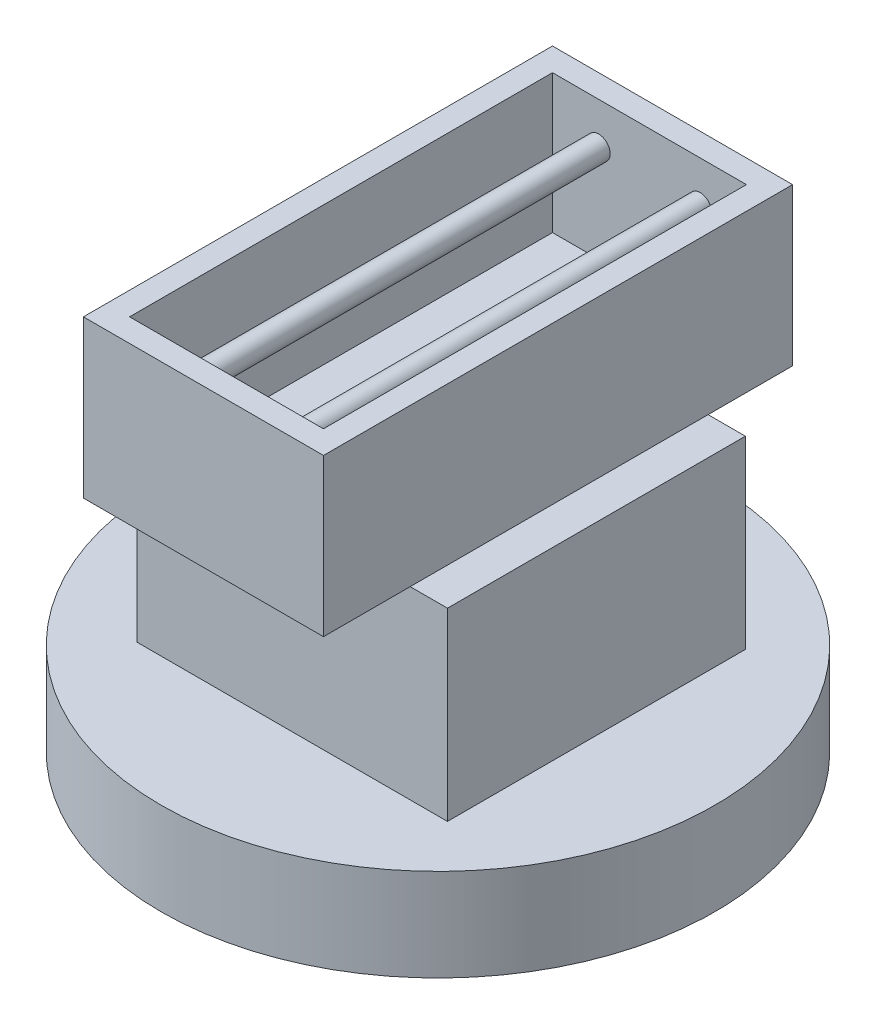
ISO-10303-21;
HEADER;
FILE_DESCRIPTION(('STEP AP214'),'2;1');
FILE_NAME('part.step','',(''),(''),'','','');
FILE_SCHEMA(('AUTOMOTIVE_DESIGN { 1 0 10303 214 1 1 1 1 }'));
ENDSEC;
DATA;
#1=APPLICATION_CONTEXT('core data for automotive mechanical design processes');
#2=APPLICATION_PROTOCOL_DEFINITION('international standard','automotive_design',2000,#1);
#3=PRODUCT_CONTEXT('',#1,'mechanical');
#4=PRODUCT('Part','Part','',(#3));
#5=PRODUCT_RELATED_PRODUCT_CATEGORY('part','',(#4));
#6=PRODUCT_DEFINITION_FORMATION('','',#4);
#7=PRODUCT_DEFINITION_CONTEXT('part definition',#1,'design');
#8=PRODUCT_DEFINITION('design','',#6,#7);
#9=PRODUCT_DEFINITION_SHAPE('','',#8);
#10=(LENGTH_UNIT() NAMED_UNIT(*) SI_UNIT(.MILLI.,.METRE.));
#11=(NAMED_UNIT(*) PLANE_ANGLE_UNIT() SI_UNIT($,.RADIAN.));
#12=(NAMED_UNIT(*) SI_UNIT($,.STERADIAN.) SOLID_ANGLE_UNIT());
#13=UNCERTAINTY_MEASURE_WITH_UNIT(LENGTH_MEASURE(1.E-05),#10,'distance_accuracy_value','');
#14=(GEOMETRIC_REPRESENTATION_CONTEXT(3) GLOBAL_UNCERTAINTY_ASSIGNED_CONTEXT((#13)) GLOBAL_UNIT_ASSIGNED_CONTEXT((#10,
#11,#12)) REPRESENTATION_CONTEXT('',''));
#15=CARTESIAN_POINT('',(0.,0.,0.));
#16=DIRECTION('',(0.,0.,1.));
#17=DIRECTION('',(1.,0.,0.));
#18=AXIS2_PLACEMENT_3D('',#15,#16,#17);
#19=CARTESIAN_POINT('',(34.0744268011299,60.,32.0256268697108));
#20=DIRECTION('',(0.,-1.,0.));
#21=DIRECTION('',(0.,0.,-1.));
#22=AXIS2_PLACEMENT_3D('',#19,#20,#21);
#23=PLANE('',#22);
#24=DIRECTION('',(0.,0.,-1.));
#25=VECTOR('',#24,1.);
#26=CARTESIAN_POINT('',(26.,60.,-50.8));
#27=LINE('',#26,#25);
#28=CARTESIAN_POINT('',(26.,60.,32.0256268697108));
#29=VERTEX_POINT('',#28);
#30=CARTESIAN_POINT('',(26.,60.,-32.5028693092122));
#31=VERTEX_POINT('',#30);
#32=EDGE_CURVE('E11',#29,#31,#27,.T.);
#33=ORIENTED_EDGE('',*,*,#32,.F.);
#34=DIRECTION('',(1.,0.,0.));
#35=VECTOR('',#34,1.);
#36=CARTESIAN_POINT('',(34.0744268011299,60.,32.0256268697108));
#37=LINE('',#36,#35);
#38=CARTESIAN_POINT('',(34.0744268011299,60.,32.0256268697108));
#39=VERTEX_POINT('',#38);
#40=EDGE_CURVE('E219',#29,#39,#37,.T.);
#41=ORIENTED_EDGE('',*,*,#40,.T.);
#42=DIRECTION('',(0.,0.,-1.));
#43=VECTOR('',#42,1.);
#44=CARTESIAN_POINT('',(34.0744268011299,60.,-32.5028693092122));
#45=LINE('',#44,#43);
#46=CARTESIAN_POINT('',(34.0744268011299,60.,-32.5028693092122));
#47=VERTEX_POINT('',#46);
#48=EDGE_CURVE('E210',#39,#47,#45,.T.);
#49=ORIENTED_EDGE('',*,*,#48,.T.);
#50=DIRECTION('',(-1.,0.,0.));
#51=VECTOR('',#50,1.);
#52=CARTESIAN_POINT('',(34.0744268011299,60.,-32.5028693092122));
#53=LINE('',#52,#51);
#54=EDGE_CURVE('E214',#47,#31,#53,.T.);
#55=ORIENTED_EDGE('',*,*,#54,.T.);
#56=EDGE_LOOP('',(#33,#41,#49,#55));
#57=FACE_BOUND('',#56,.T.);
#58=ADVANCED_FACE('F26',(#57),#23,.F.);
#59=DIRECTION('',(0.,0.,1.));
#60=VECTOR('',#59,1.);
#61=CARTESIAN_POINT('',(-26.,60.,-50.8));
#62=LINE('',#61,#60);
#63=CARTESIAN_POINT('',(-26.,60.,-32.5028693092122));
#64=VERTEX_POINT('',#63);
#65=CARTESIAN_POINT('',(-26.,60.,32.0256268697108));
#66=VERTEX_POINT('',#65);
#67=EDGE_CURVE('E35',#64,#66,#62,.T.);
#68=ORIENTED_EDGE('',*,*,#67,.F.);
#69=CARTESIAN_POINT('',(-33.1710996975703,60.,-32.5028693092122));
#70=VERTEX_POINT('',#69);
#71=EDGE_CURVE('E213',#64,#70,#53,.T.);
#72=ORIENTED_EDGE('',*,*,#71,.T.);
#73=DIRECTION('',(0.,0.,1.));
#74=VECTOR('',#73,1.);
#75=CARTESIAN_POINT('',(-33.1710996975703,60.,-32.5028693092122));
#76=LINE('',#75,#74);
#77=CARTESIAN_POINT('',(-33.1710996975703,60.,32.0256268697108));
#78=VERTEX_POINT('',#77);
#79=EDGE_CURVE('E216',#70,#78,#76,.T.);
#80=ORIENTED_EDGE('',*,*,#79,.T.);
#81=EDGE_CURVE('E220',#78,#66,#37,.T.);
#82=ORIENTED_EDGE('',*,*,#81,.T.);
#83=EDGE_LOOP('',(#68,#72,#80,#82));
#84=FACE_BOUND('',#83,.T.);
#85=ADVANCED_FACE('F272',(#84),#23,.F.);
#86=CARTESIAN_POINT('',(0.,20.,0.));
#87=DIRECTION('',(0.,1.,0.));
#88=DIRECTION('',(0.,0.,1.));
#89=AXIS2_PLACEMENT_3D('',#86,#87,#88);
#90=PLANE('',#89);
#91=CARTESIAN_POINT('',(0.,20.,0.));
#92=DIRECTION('',(0.,1.,0.));
#93=DIRECTION('',(0.,0.,1.));
#94=AXIS2_PLACEMENT_3D('',#91,#92,#93);
#95=CIRCLE('',#94,60.);
#96=CARTESIAN_POINT('',(0.,20.,60.));
#97=VERTEX_POINT('',#96);
#98=EDGE_CURVE('E236',#97,#97,#95,.T.);
#99=ORIENTED_EDGE('',*,*,#98,.T.);
#100=EDGE_LOOP('',(#99));
#101=FACE_BOUND('',#100,.T.);
#102=DIRECTION('',(-1.,0.,0.));
#103=VECTOR('',#102,1.);
#104=CARTESIAN_POINT('',(34.0744268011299,20.,-32.5028693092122));
#105=LINE('',#104,#103);
#106=CARTESIAN_POINT('',(34.0744268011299,20.,-32.5028693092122));
#107=VERTEX_POINT('',#106);
#108=CARTESIAN_POINT('',(-33.1710996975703,20.,-32.5028693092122));
#109=VERTEX_POINT('',#108);
#110=EDGE_CURVE('E203',#107,#109,#105,.T.);
#111=ORIENTED_EDGE('',*,*,#110,.F.);
#112=DIRECTION('',(0.,0.,-1.));
#113=VECTOR('',#112,1.);
#114=CARTESIAN_POINT('',(34.0744268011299,20.,-32.5028693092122));
#115=LINE('',#114,#113);
#116=CARTESIAN_POINT('',(34.0744268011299,20.,32.0256268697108));
#117=VERTEX_POINT('',#116);
#118=EDGE_CURVE('E200',#117,#107,#115,.T.);
#119=ORIENTED_EDGE('',*,*,#118,.F.);
#120=DIRECTION('',(1.,0.,0.));
#121=VECTOR('',#120,1.);
#122=CARTESIAN_POINT('',(34.0744268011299,20.,32.0256268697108));
#123=LINE('',#122,#121);
#124=CARTESIAN_POINT('',(-33.1710996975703,20.,32.0256268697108));
#125=VERTEX_POINT('',#124);
#126=EDGE_CURVE('E208',#125,#117,#123,.T.);
#127=ORIENTED_EDGE('',*,*,#126,.F.);
#128=DIRECTION('',(0.,0.,1.));
#129=VECTOR('',#128,1.);
#130=CARTESIAN_POINT('',(-33.1710996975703,20.,-32.5028693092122));
#131=LINE('',#130,#129);
#132=EDGE_CURVE('E205',#109,#125,#131,.T.);
#133=ORIENTED_EDGE('',*,*,#132,.F.);
#134=EDGE_LOOP('',(#111,#119,#127,#133));
#135=FACE_BOUND('',#134,.T.);
#136=ADVANCED_FACE('F278',(#101,#135),#90,.T.);
#137=CARTESIAN_POINT('',(0.,-20.,0.));
#138=DIRECTION('',(0.,1.,0.));
#139=DIRECTION('',(0.,0.,1.));
#140=AXIS2_PLACEMENT_3D('',#137,#138,#139);
#141=CYLINDRICAL_SURFACE('',#140,25.);
#142=CARTESIAN_POINT('',(0.,-20.,0.));
#143=DIRECTION('',(0.,1.,0.));
#144=DIRECTION('',(0.,0.,1.));
#145=AXIS2_PLACEMENT_3D('',#142,#143,#144);
#146=CIRCLE('',#145,25.);
#147=CARTESIAN_POINT('',(0.,-20.,25.));
#148=VERTEX_POINT('',#147);
#149=EDGE_CURVE('E242',#148,#148,#146,.T.);
#150=ORIENTED_EDGE('',*,*,#149,.T.);
#151=EDGE_LOOP('',(#150));
#152=FACE_BOUND('',#151,.T.);
#153=CARTESIAN_POINT('',(0.,0.,0.));
#154=DIRECTION('',(0.,1.,0.));
#155=DIRECTION('',(0.,0.,1.));
#156=AXIS2_PLACEMENT_3D('',#153,#154,#155);
#157=CIRCLE('',#156,25.);
#158=CARTESIAN_POINT('',(0.,0.,25.));
#159=VERTEX_POINT('',#158);
#160=EDGE_CURVE('E239',#159,#159,#157,.T.);
#161=ORIENTED_EDGE('',*,*,#160,.F.);
#162=EDGE_LOOP('',(#161));
#163=FACE_BOUND('',#162,.T.);
#164=ADVANCED_FACE('F28',(#152,#163),#141,.T.);
#165=CARTESIAN_POINT('',(0.,-20.,0.));
#166=DIRECTION('',(0.,1.,0.));
#167=DIRECTION('',(0.,0.,1.));
#168=AXIS2_PLACEMENT_3D('',#165,#166,#167);
#169=PLANE('',#168);
#170=ORIENTED_EDGE('',*,*,#149,.F.);
#171=EDGE_LOOP('',(#170));
#172=FACE_BOUND('',#171,.T.);
#173=ADVANCED_FACE('F309',(#172),#169,.F.);
#174=CARTESIAN_POINT('',(0.,20.,0.));
#175=DIRECTION('',(0.,-1.,0.));
#176=DIRECTION('',(0.,0.,-1.));
#177=AXIS2_PLACEMENT_3D('',#174,#175,#176);
#178=CYLINDRICAL_SURFACE('',#177,60.);
#179=ORIENTED_EDGE('',*,*,#98,.F.);
#180=EDGE_LOOP('',(#179));
#181=FACE_BOUND('',#180,.T.);
#182=CARTESIAN_POINT('',(0.,0.,0.));
#183=DIRECTION('',(0.,1.,0.));
#184=DIRECTION('',(0.,0.,1.));
#185=AXIS2_PLACEMENT_3D('',#182,#183,#184);
#186=CIRCLE('',#185,60.);
#187=CARTESIAN_POINT('',(0.,0.,60.));
#188=VERTEX_POINT('',#187);
#189=EDGE_CURVE('E233',#188,#188,#186,.T.);
#190=ORIENTED_EDGE('',*,*,#189,.T.);
#191=EDGE_LOOP('',(#190));
#192=FACE_BOUND('',#191,.T.);
#193=ADVANCED_FACE('F303',(#181,#192),#178,.T.);
#194=CARTESIAN_POINT('',(0.,0.,0.));
#195=DIRECTION('',(0.,1.,0.));
#196=DIRECTION('',(0.,0.,1.));
#197=AXIS2_PLACEMENT_3D('',#194,#195,#196);
#198=PLANE('',#197);
#199=ORIENTED_EDGE('',*,*,#160,.T.);
#200=EDGE_LOOP('',(#199));
#201=FACE_BOUND('',#200,.T.);
#202=ORIENTED_EDGE('',*,*,#189,.F.);
#203=EDGE_LOOP('',(#202));
#204=FACE_BOUND('',#203,.T.);
#205=ADVANCED_FACE('F299',(#201,#204),#198,.F.);
#206=CARTESIAN_POINT('',(34.0744268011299,60.,-32.5028693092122));
#207=DIRECTION('',(-1.,0.,0.));
#208=DIRECTION('',(0.,0.,1.));
#209=AXIS2_PLACEMENT_3D('',#206,#207,#208);
#210=PLANE('',#209);
#211=ORIENTED_EDGE('',*,*,#118,.T.);
#212=DIRECTION('',(0.,-1.,0.));
#213=VECTOR('',#212,1.);
#214=CARTESIAN_POINT('',(34.0744268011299,60.,-32.5028693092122));
#215=LINE('',#214,#213);
#216=EDGE_CURVE('E231',#47,#107,#215,.T.);
#217=ORIENTED_EDGE('',*,*,#216,.F.);
#218=ORIENTED_EDGE('',*,*,#48,.F.);
#219=DIRECTION('',(0.,-1.,0.));
#220=VECTOR('',#219,1.);
#221=CARTESIAN_POINT('',(34.0744268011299,60.,32.0256268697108));
#222=LINE('',#221,#220);
#223=EDGE_CURVE('E222',#39,#117,#222,.T.);
#224=ORIENTED_EDGE('',*,*,#223,.T.);
#225=EDGE_LOOP('',(#211,#217,#218,#224));
#226=FACE_BOUND('',#225,.T.);
#227=ADVANCED_FACE('F295',(#226),#210,.F.);
#228=CARTESIAN_POINT('',(34.0744268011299,60.,-32.5028693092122));
#229=DIRECTION('',(0.,0.,1.));
#230=DIRECTION('',(1.,0.,0.));
#231=AXIS2_PLACEMENT_3D('',#228,#229,#230);
#232=PLANE('',#231);
#233=ORIENTED_EDGE('',*,*,#110,.T.);
#234=DIRECTION('',(0.,-1.,0.));
#235=VECTOR('',#234,1.);
#236=CARTESIAN_POINT('',(-33.1710996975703,60.,-32.5028693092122));
#237=LINE('',#236,#235);
#238=EDGE_CURVE('E228',#70,#109,#237,.T.);
#239=ORIENTED_EDGE('',*,*,#238,.F.);
#240=ORIENTED_EDGE('',*,*,#71,.F.);
#241=EDGE_CURVE('E217',#31,#64,#53,.T.);
#242=ORIENTED_EDGE('',*,*,#241,.F.);
#243=ORIENTED_EDGE('',*,*,#54,.F.);
#244=ORIENTED_EDGE('',*,*,#216,.T.);
#245=EDGE_LOOP('',(#233,#239,#240,#242,#243,#244));
#246=FACE_BOUND('',#245,.T.);
#247=ADVANCED_FACE('F291',(#246),#232,.F.);
#248=CARTESIAN_POINT('',(-33.1710996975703,60.,-32.5028693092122));
#249=DIRECTION('',(1.,0.,0.));
#250=DIRECTION('',(0.,0.,-1.));
#251=AXIS2_PLACEMENT_3D('',#248,#249,#250);
#252=PLANE('',#251);
#253=ORIENTED_EDGE('',*,*,#132,.T.);
#254=DIRECTION('',(0.,-1.,0.));
#255=VECTOR('',#254,1.);
#256=CARTESIAN_POINT('',(-33.1710996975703,60.,32.0256268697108));
#257=LINE('',#256,#255);
#258=EDGE_CURVE('E226',#78,#125,#257,.T.);
#259=ORIENTED_EDGE('',*,*,#258,.F.);
#260=ORIENTED_EDGE('',*,*,#79,.F.);
#261=ORIENTED_EDGE('',*,*,#238,.T.);
#262=EDGE_LOOP('',(#253,#259,#260,#261));
#263=FACE_BOUND('',#262,.T.);
#264=ADVANCED_FACE('F288',(#263),#252,.F.);
#265=CARTESIAN_POINT('',(34.0744268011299,60.,32.0256268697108));
#266=DIRECTION('',(0.,0.,-1.));
#267=DIRECTION('',(-1.,0.,0.));
#268=AXIS2_PLACEMENT_3D('',#265,#266,#267);
#269=PLANE('',#268);
#270=ORIENTED_EDGE('',*,*,#126,.T.);
#271=ORIENTED_EDGE('',*,*,#223,.F.);
#272=ORIENTED_EDGE('',*,*,#40,.F.);
#273=EDGE_CURVE('E223',#66,#29,#37,.T.);
#274=ORIENTED_EDGE('',*,*,#273,.F.);
#275=ORIENTED_EDGE('',*,*,#81,.F.);
#276=ORIENTED_EDGE('',*,*,#258,.T.);
#277=EDGE_LOOP('',(#270,#271,#272,#274,#275,#276));
#278=FACE_BOUND('',#277,.T.);
#279=ADVANCED_FACE('F284',(#278),#269,.F.);
#280=CARTESIAN_POINT('',(26.,60.,50.8));
#281=DIRECTION('',(0.,-1.,0.));
#282=DIRECTION('',(0.,0.,-1.));
#283=AXIS2_PLACEMENT_3D('',#280,#281,#282);
#284=PLANE('',#283);
#285=CARTESIAN_POINT('',(26.,60.,-50.8));
#286=VERTEX_POINT('',#285);
#287=EDGE_CURVE('E38',#31,#286,#27,.T.);
#288=ORIENTED_EDGE('',*,*,#287,.F.);
#289=ORIENTED_EDGE('',*,*,#241,.T.);
#290=CARTESIAN_POINT('',(-26.,60.,-50.8));
#291=VERTEX_POINT('',#290);
#292=EDGE_CURVE('E174',#291,#64,#62,.T.);
#293=ORIENTED_EDGE('',*,*,#292,.F.);
#294=DIRECTION('',(-1.,0.,0.));
#295=VECTOR('',#294,1.);
#296=CARTESIAN_POINT('',(26.,60.,-50.8));
#297=LINE('',#296,#295);
#298=EDGE_CURVE('E171',#286,#291,#297,.T.);
#299=ORIENTED_EDGE('',*,*,#298,.F.);
#300=EDGE_LOOP('',(#288,#289,#293,#299));
#301=FACE_BOUND('',#300,.T.);
#302=ADVANCED_FACE('F287',(#301),#284,.T.);
#303=CARTESIAN_POINT('',(26.,94.,-50.8));
#304=DIRECTION('',(-1.,0.,0.));
#305=DIRECTION('',(0.,0.,1.));
#306=AXIS2_PLACEMENT_3D('',#303,#304,#305);
#307=PLANE('',#306);
#308=CARTESIAN_POINT('',(26.,60.,50.8));
#309=VERTEX_POINT('',#308);
#310=EDGE_CURVE('E37',#309,#29,#27,.T.);
#311=ORIENTED_EDGE('',*,*,#310,.T.);
#312=ORIENTED_EDGE('',*,*,#32,.T.);
#313=ORIENTED_EDGE('',*,*,#287,.T.);
#314=DIRECTION('',(0.,-1.,0.));
#315=VECTOR('',#314,1.);
#316=CARTESIAN_POINT('',(26.,94.,-50.8));
#317=LINE('',#316,#315);
#318=CARTESIAN_POINT('',(26.,94.,-50.8));
#319=VERTEX_POINT('',#318);
#320=EDGE_CURVE('E197',#319,#286,#317,.T.);
#321=ORIENTED_EDGE('',*,*,#320,.F.);
#322=DIRECTION('',(0.,0.,-1.));
#323=VECTOR('',#322,1.);
#324=CARTESIAN_POINT('',(26.,94.,-50.8));
#325=LINE('',#324,#323);
#326=CARTESIAN_POINT('',(26.,94.,50.8));
#327=VERTEX_POINT('',#326);
#328=EDGE_CURVE('E179',#327,#319,#325,.T.);
#329=ORIENTED_EDGE('',*,*,#328,.F.);
#330=DIRECTION('',(0.,-1.,0.));
#331=VECTOR('',#330,1.);
#332=CARTESIAN_POINT('',(26.,94.,50.8));
#333=LINE('',#332,#331);
#334=EDGE_CURVE('E188',#327,#309,#333,.T.);
#335=ORIENTED_EDGE('',*,*,#334,.T.);
#336=EDGE_LOOP('',(#311,#312,#313,#321,#329,#335));
#337=FACE_BOUND('',#336,.T.);
#338=ADVANCED_FACE('F282',(#337),#307,.F.);
#339=CARTESIAN_POINT('',(26.,94.,-50.8));
#340=DIRECTION('',(0.,0.,1.));
#341=DIRECTION('',(1.,0.,0.));
#342=AXIS2_PLACEMENT_3D('',#339,#340,#341);
#343=PLANE('',#342);
#344=ORIENTED_EDGE('',*,*,#298,.T.);
#345=DIRECTION('',(0.,-1.,0.));
#346=VECTOR('',#345,1.);
#347=CARTESIAN_POINT('',(-26.,94.,-50.8));
#348=LINE('',#347,#346);
#349=CARTESIAN_POINT('',(-26.,94.,-50.8));
#350=VERTEX_POINT('',#349);
#351=EDGE_CURVE('E194',#350,#291,#348,.T.);
#352=ORIENTED_EDGE('',*,*,#351,.F.);
#353=DIRECTION('',(-1.,0.,0.));
#354=VECTOR('',#353,1.);
#355=CARTESIAN_POINT('',(26.,94.,-50.8));
#356=LINE('',#355,#354);
#357=EDGE_CURVE('E182',#319,#350,#356,.T.);
#358=ORIENTED_EDGE('',*,*,#357,.F.);
#359=ORIENTED_EDGE('',*,*,#320,.T.);
#360=EDGE_LOOP('',(#344,#352,#358,#359));
#361=FACE_BOUND('',#360,.T.);
#362=ADVANCED_FACE('F376',(#361),#343,.F.);
#363=CARTESIAN_POINT('',(-26.,94.,-50.8));
#364=DIRECTION('',(1.,0.,0.));
#365=DIRECTION('',(0.,0.,-1.));
#366=AXIS2_PLACEMENT_3D('',#363,#364,#365);
#367=PLANE('',#366);
#368=ORIENTED_EDGE('',*,*,#292,.T.);
#369=ORIENTED_EDGE('',*,*,#67,.T.);
#370=CARTESIAN_POINT('',(-26.,60.,50.8));
#371=VERTEX_POINT('',#370);
#372=EDGE_CURVE('E173',#66,#371,#62,.T.);
#373=ORIENTED_EDGE('',*,*,#372,.T.);
#374=DIRECTION('',(0.,-1.,0.));
#375=VECTOR('',#374,1.);
#376=CARTESIAN_POINT('',(-26.,94.,50.8));
#377=LINE('',#376,#375);
#378=CARTESIAN_POINT('',(-26.,94.,50.8));
#379=VERTEX_POINT('',#378);
#380=EDGE_CURVE('E191',#379,#371,#377,.T.);
#381=ORIENTED_EDGE('',*,*,#380,.F.);
#382=DIRECTION('',(0.,0.,1.));
#383=VECTOR('',#382,1.);
#384=CARTESIAN_POINT('',(-26.,94.,-50.8));
#385=LINE('',#384,#383);
#386=EDGE_CURVE('E184',#350,#379,#385,.T.);
#387=ORIENTED_EDGE('',*,*,#386,.F.);
#388=ORIENTED_EDGE('',*,*,#351,.T.);
#389=EDGE_LOOP('',(#368,#369,#373,#381,#387,#388));
#390=FACE_BOUND('',#389,.T.);
#391=ADVANCED_FACE('F384',(#390),#367,.F.);
#392=CARTESIAN_POINT('',(26.,94.,50.8));
#393=DIRECTION('',(0.,0.,-1.));
#394=DIRECTION('',(-1.,0.,0.));
#395=AXIS2_PLACEMENT_3D('',#392,#393,#394);
#396=PLANE('',#395);
#397=DIRECTION('',(1.,0.,0.));
#398=VECTOR('',#397,1.);
#399=CARTESIAN_POINT('',(26.,60.,50.8));
#400=LINE('',#399,#398);
#401=EDGE_CURVE('E177',#371,#309,#400,.T.);
#402=ORIENTED_EDGE('',*,*,#401,.T.);
#403=ORIENTED_EDGE('',*,*,#334,.F.);
#404=DIRECTION('',(1.,0.,0.));
#405=VECTOR('',#404,1.);
#406=CARTESIAN_POINT('',(26.,94.,50.8));
#407=LINE('',#406,#405);
#408=EDGE_CURVE('E186',#379,#327,#407,.T.);
#409=ORIENTED_EDGE('',*,*,#408,.F.);
#410=ORIENTED_EDGE('',*,*,#380,.T.);
#411=EDGE_LOOP('',(#402,#403,#409,#410));
#412=FACE_BOUND('',#411,.T.);
#413=ADVANCED_FACE('F392',(#412),#396,.F.);
#414=CARTESIAN_POINT('',(26.,94.,50.8));
#415=DIRECTION('',(0.,-1.,0.));
#416=DIRECTION('',(0.,0.,-1.));
#417=AXIS2_PLACEMENT_3D('',#414,#415,#416);
#418=PLANE('',#417);
#419=DIRECTION('',(0.,0.,-1.));
#420=VECTOR('',#419,1.);
#421=CARTESIAN_POINT('',(21.,94.,45.8));
#422=LINE('',#421,#420);
#423=CARTESIAN_POINT('',(21.,94.,45.8));
#424=VERTEX_POINT('',#423);
#425=CARTESIAN_POINT('',(21.,94.,-45.8));
#426=VERTEX_POINT('',#425);
#427=EDGE_CURVE('E145',#424,#426,#422,.T.);
#428=ORIENTED_EDGE('',*,*,#427,.F.);
#429=DIRECTION('',(1.,0.,0.));
#430=VECTOR('',#429,1.);
#431=CARTESIAN_POINT('',(-21.,94.,45.8));
#432=LINE('',#431,#430);
#433=CARTESIAN_POINT('',(-21.,94.,45.8));
#434=VERTEX_POINT('',#433);
#435=EDGE_CURVE('E45',#434,#424,#432,.T.);
#436=ORIENTED_EDGE('',*,*,#435,.F.);
#437=DIRECTION('',(0.,0.,1.));
#438=VECTOR('',#437,1.);
#439=CARTESIAN_POINT('',(-21.,94.,-45.8));
#440=LINE('',#439,#438);
#441=CARTESIAN_POINT('',(-21.,94.,-45.8));
#442=VERTEX_POINT('',#441);
#443=EDGE_CURVE('E152',#442,#434,#440,.T.);
#444=ORIENTED_EDGE('',*,*,#443,.F.);
#445=DIRECTION('',(-1.,0.,0.));
#446=VECTOR('',#445,1.);
#447=CARTESIAN_POINT('',(21.,94.,-45.8));
#448=LINE('',#447,#446);
#449=EDGE_CURVE('E134',#426,#442,#448,.T.);
#450=ORIENTED_EDGE('',*,*,#449,.F.);
#451=EDGE_LOOP('',(#428,#436,#444,#450));
#452=FACE_BOUND('',#451,.T.);
#453=ORIENTED_EDGE('',*,*,#328,.T.);
#454=ORIENTED_EDGE('',*,*,#357,.T.);
#455=ORIENTED_EDGE('',*,*,#386,.T.);
#456=ORIENTED_EDGE('',*,*,#408,.T.);
#457=EDGE_LOOP('',(#453,#454,#455,#456));
#458=FACE_BOUND('',#457,.T.);
#459=ADVANCED_FACE('F149',(#452,#458),#418,.F.);
#460=ORIENTED_EDGE('',*,*,#372,.F.);
#461=ORIENTED_EDGE('',*,*,#273,.T.);
#462=ORIENTED_EDGE('',*,*,#310,.F.);
#463=ORIENTED_EDGE('',*,*,#401,.F.);
#464=EDGE_LOOP('',(#460,#461,#462,#463));
#465=FACE_BOUND('',#464,.T.);
#466=ADVANCED_FACE('F370',(#465),#284,.T.);
#467=CARTESIAN_POINT('',(-21.,64.,45.8));
#468=DIRECTION('',(0.,0.,1.));
#469=DIRECTION('',(1.,0.,0.));
#470=AXIS2_PLACEMENT_3D('',#467,#468,#469);
#471=PLANE('',#470);
#472=CARTESIAN_POINT('',(-11.,85.,45.8));
#473=DIRECTION('',(0.,0.,1.));
#474=DIRECTION('',(1.,0.,0.));
#475=AXIS2_PLACEMENT_3D('',#472,#473,#474);
#476=CIRCLE('',#475,2.5);
#477=CARTESIAN_POINT('',(-8.5,85.,45.8));
#478=VERTEX_POINT('',#477);
#479=EDGE_CURVE('E247',#478,#478,#476,.T.);
#480=ORIENTED_EDGE('',*,*,#479,.T.);
#481=EDGE_LOOP('',(#480));
#482=FACE_BOUND('',#481,.T.);
#483=CARTESIAN_POINT('',(11.,85.,45.8));
#484=DIRECTION('',(0.,0.,1.));
#485=DIRECTION('',(1.,0.,0.));
#486=AXIS2_PLACEMENT_3D('',#483,#484,#485);
#487=CIRCLE('',#486,2.5);
#488=CARTESIAN_POINT('',(13.5,85.,45.8));
#489=VERTEX_POINT('',#488);
#490=EDGE_CURVE('E246',#489,#489,#487,.T.);
#491=ORIENTED_EDGE('',*,*,#490,.T.);
#492=EDGE_LOOP('',(#491));
#493=FACE_BOUND('',#492,.T.);
#494=ORIENTED_EDGE('',*,*,#435,.T.);
#495=DIRECTION('',(0.,1.,0.));
#496=VECTOR('',#495,1.);
#497=CARTESIAN_POINT('',(21.,64.,45.8));
#498=LINE('',#497,#496);
#499=CARTESIAN_POINT('',(21.,64.,45.8));
#500=VERTEX_POINT('',#499);
#501=EDGE_CURVE('E142',#500,#424,#498,.T.);
#502=ORIENTED_EDGE('',*,*,#501,.F.);
#503=DIRECTION('',(1.,0.,0.));
#504=VECTOR('',#503,1.);
#505=CARTESIAN_POINT('',(-21.,64.,45.8));
#506=LINE('',#505,#504);
#507=CARTESIAN_POINT('',(-21.,64.,45.8));
#508=VERTEX_POINT('',#507);
#509=EDGE_CURVE('E154',#508,#500,#506,.T.);
#510=ORIENTED_EDGE('',*,*,#509,.F.);
#511=DIRECTION('',(0.,1.,0.));
#512=VECTOR('',#511,1.);
#513=CARTESIAN_POINT('',(-21.,64.,45.8));
#514=LINE('',#513,#512);
#515=EDGE_CURVE('E166',#508,#434,#514,.T.);
#516=ORIENTED_EDGE('',*,*,#515,.T.);
#517=EDGE_LOOP('',(#494,#502,#510,#516));
#518=FACE_BOUND('',#517,.T.);
#519=ADVANCED_FACE('F414',(#482,#493,#518),#471,.F.);
#520=CARTESIAN_POINT('',(-21.,64.,-45.8));
#521=DIRECTION('',(-1.,0.,0.));
#522=DIRECTION('',(0.,0.,1.));
#523=AXIS2_PLACEMENT_3D('',#520,#521,#522);
#524=PLANE('',#523);
#525=ORIENTED_EDGE('',*,*,#443,.T.);
#526=ORIENTED_EDGE('',*,*,#515,.F.);
#527=DIRECTION('',(0.,0.,1.));
#528=VECTOR('',#527,1.);
#529=CARTESIAN_POINT('',(-21.,64.,-45.8));
#530=LINE('',#529,#528);
#531=CARTESIAN_POINT('',(-21.,64.,-45.8));
#532=VERTEX_POINT('',#531);
#533=EDGE_CURVE('E163',#532,#508,#530,.T.);
#534=ORIENTED_EDGE('',*,*,#533,.F.);
#535=DIRECTION('',(0.,1.,0.));
#536=VECTOR('',#535,1.);
#537=CARTESIAN_POINT('',(-21.,64.,-45.8));
#538=LINE('',#537,#536);
#539=EDGE_CURVE('E141',#532,#442,#538,.T.);
#540=ORIENTED_EDGE('',*,*,#539,.T.);
#541=EDGE_LOOP('',(#525,#526,#534,#540));
#542=FACE_BOUND('',#541,.T.);
#543=ADVANCED_FACE('F420',(#542),#524,.F.);
#544=CARTESIAN_POINT('',(21.,64.,-45.8));
#545=DIRECTION('',(0.,0.,-1.));
#546=DIRECTION('',(-1.,0.,0.));
#547=AXIS2_PLACEMENT_3D('',#544,#545,#546);
#548=PLANE('',#547);
#549=CARTESIAN_POINT('',(-11.,85.,-45.8));
#550=DIRECTION('',(0.,0.,-1.));
#551=DIRECTION('',(-1.,0.,0.));
#552=AXIS2_PLACEMENT_3D('',#549,#550,#551);
#553=CIRCLE('',#552,2.5);
#554=CARTESIAN_POINT('',(-8.5,85.,-45.8));
#555=VERTEX_POINT('',#554);
#556=EDGE_CURVE('E30',#555,#555,#553,.T.);
#557=ORIENTED_EDGE('',*,*,#556,.T.);
#558=EDGE_LOOP('',(#557));
#559=FACE_BOUND('',#558,.T.);
#560=CARTESIAN_POINT('',(11.,85.,-45.8));
#561=DIRECTION('',(0.,0.,-1.));
#562=DIRECTION('',(-1.,0.,0.));
#563=AXIS2_PLACEMENT_3D('',#560,#561,#562);
#564=CIRCLE('',#563,2.5);
#565=CARTESIAN_POINT('',(13.5,85.,-45.8));
#566=VERTEX_POINT('',#565);
#567=EDGE_CURVE('E244',#566,#566,#564,.T.);
#568=ORIENTED_EDGE('',*,*,#567,.T.);
#569=EDGE_LOOP('',(#568));
#570=FACE_BOUND('',#569,.T.);
#571=ORIENTED_EDGE('',*,*,#449,.T.);
#572=ORIENTED_EDGE('',*,*,#539,.F.);
#573=DIRECTION('',(-1.,0.,0.));
#574=VECTOR('',#573,1.);
#575=CARTESIAN_POINT('',(21.,64.,-45.8));
#576=LINE('',#575,#574);
#577=CARTESIAN_POINT('',(21.,64.,-45.8));
#578=VERTEX_POINT('',#577);
#579=EDGE_CURVE('E137',#578,#532,#576,.T.);
#580=ORIENTED_EDGE('',*,*,#579,.F.);
#581=DIRECTION('',(0.,1.,0.));
#582=VECTOR('',#581,1.);
#583=CARTESIAN_POINT('',(21.,64.,-45.8));
#584=LINE('',#583,#582);
#585=EDGE_CURVE('E130',#578,#426,#584,.T.);
#586=ORIENTED_EDGE('',*,*,#585,.T.);
#587=EDGE_LOOP('',(#571,#572,#580,#586));
#588=FACE_BOUND('',#587,.T.);
#589=ADVANCED_FACE('F132',(#559,#570,#588),#548,.F.);
#590=CARTESIAN_POINT('',(21.,64.,45.8));
#591=DIRECTION('',(1.,0.,0.));
#592=DIRECTION('',(0.,0.,-1.));
#593=AXIS2_PLACEMENT_3D('',#590,#591,#592);
#594=PLANE('',#593);
#595=ORIENTED_EDGE('',*,*,#427,.T.);
#596=ORIENTED_EDGE('',*,*,#585,.F.);
#597=DIRECTION('',(0.,0.,-1.));
#598=VECTOR('',#597,1.);
#599=CARTESIAN_POINT('',(21.,64.,45.8));
#600=LINE('',#599,#598);
#601=EDGE_CURVE('E160',#500,#578,#600,.T.);
#602=ORIENTED_EDGE('',*,*,#601,.F.);
#603=ORIENTED_EDGE('',*,*,#501,.T.);
#604=EDGE_LOOP('',(#595,#596,#602,#603));
#605=FACE_BOUND('',#604,.T.);
#606=ADVANCED_FACE('F146',(#605),#594,.F.);
#607=CARTESIAN_POINT('',(21.,64.,45.8));
#608=DIRECTION('',(0.,1.,0.));
#609=DIRECTION('',(0.,0.,1.));
#610=AXIS2_PLACEMENT_3D('',#607,#608,#609);
#611=PLANE('',#610);
#612=ORIENTED_EDGE('',*,*,#509,.T.);
#613=ORIENTED_EDGE('',*,*,#601,.T.);
#614=ORIENTED_EDGE('',*,*,#579,.T.);
#615=ORIENTED_EDGE('',*,*,#533,.T.);
#616=EDGE_LOOP('',(#612,#613,#614,#615));
#617=FACE_BOUND('',#616,.T.);
#618=ADVANCED_FACE('F268',(#617),#611,.T.);
#619=CARTESIAN_POINT('',(11.,85.,-57.8710678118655));
#620=DIRECTION('',(0.,0.,1.));
#621=DIRECTION('',(1.,0.,0.));
#622=AXIS2_PLACEMENT_3D('',#619,#620,#621);
#623=CYLINDRICAL_SURFACE('',#622,2.5);
#624=CARTESIAN_POINT('',(13.5,85.,-45.8));
#625=CARTESIAN_POINT('',(13.5,85.,-44.8458333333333));
#626=CARTESIAN_POINT('',(13.5,85.,-43.8916666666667));
#627=CARTESIAN_POINT('',(13.5,85.,-41.9833333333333));
#628=CARTESIAN_POINT('',(13.5,85.,-41.0291666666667));
#629=CARTESIAN_POINT('',(13.5,85.,-39.1208333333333));
#630=CARTESIAN_POINT('',(13.5,85.,-38.1666666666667));
#631=CARTESIAN_POINT('',(13.5,85.,-36.2583333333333));
#632=CARTESIAN_POINT('',(13.5,85.,-35.3041666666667));
#633=CARTESIAN_POINT('',(13.5,85.,-33.3958333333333));
#634=CARTESIAN_POINT('',(13.5,85.,-32.4416666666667));
#635=CARTESIAN_POINT('',(13.5,85.,-30.5333333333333));
#636=CARTESIAN_POINT('',(13.5,85.,-29.5791666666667));
#637=CARTESIAN_POINT('',(13.5,85.,-27.6708333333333));
#638=CARTESIAN_POINT('',(13.5,85.,-26.7166666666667));
#639=CARTESIAN_POINT('',(13.5,85.,-24.8083333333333));
#640=CARTESIAN_POINT('',(13.5,85.,-23.8541666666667));
#641=CARTESIAN_POINT('',(13.5,85.,-21.9458333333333));
#642=CARTESIAN_POINT('',(13.5,85.,-20.9916666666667));
#643=CARTESIAN_POINT('',(13.5,85.,-19.0833333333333));
#644=CARTESIAN_POINT('',(13.5,85.,-18.1291666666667));
#645=CARTESIAN_POINT('',(13.5,85.,-16.2208333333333));
#646=CARTESIAN_POINT('',(13.5,85.,-15.2666666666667));
#647=CARTESIAN_POINT('',(13.5,85.,-13.3583333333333));
#648=CARTESIAN_POINT('',(13.5,85.,-12.4041666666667));
#649=CARTESIAN_POINT('',(13.5,85.,-10.4958333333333));
#650=CARTESIAN_POINT('',(13.5,85.,-9.54166666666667));
#651=CARTESIAN_POINT('',(13.5,85.,-7.63333333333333));
#652=CARTESIAN_POINT('',(13.5,85.,-6.67916666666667));
#653=CARTESIAN_POINT('',(13.5,85.,-4.77083333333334));
#654=CARTESIAN_POINT('',(13.5,85.,-3.81666666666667));
#655=CARTESIAN_POINT('',(13.5,85.,-1.90833333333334));
#656=CARTESIAN_POINT('',(13.5,85.,-0.954166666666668));
#657=CARTESIAN_POINT('',(13.5,85.,0.954166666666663));
#658=CARTESIAN_POINT('',(13.5,85.,1.90833333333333));
#659=CARTESIAN_POINT('',(13.5,85.,3.81666666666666));
#660=CARTESIAN_POINT('',(13.5,85.,4.77083333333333));
#661=CARTESIAN_POINT('',(13.5,85.,6.67916666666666));
#662=CARTESIAN_POINT('',(13.5,85.,7.63333333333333));
#663=CARTESIAN_POINT('',(13.5,85.,9.54166666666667));
#664=CARTESIAN_POINT('',(13.5,85.,10.4958333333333));
#665=CARTESIAN_POINT('',(13.5,85.,12.4041666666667));
#666=CARTESIAN_POINT('',(13.5,85.,13.3583333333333));
#667=CARTESIAN_POINT('',(13.5,85.,15.2666666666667));
#668=CARTESIAN_POINT('',(13.5,85.,16.2208333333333));
#669=CARTESIAN_POINT('',(13.5,85.,18.1291666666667));
#670=CARTESIAN_POINT('',(13.5,85.,19.0833333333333));
#671=CARTESIAN_POINT('',(13.5,85.,20.9916666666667));
#672=CARTESIAN_POINT('',(13.5,85.,21.9458333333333));
#673=CARTESIAN_POINT('',(13.5,85.,23.8541666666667));
#674=CARTESIAN_POINT('',(13.5,85.,24.8083333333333));
#675=CARTESIAN_POINT('',(13.5,85.,26.7166666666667));
#676=CARTESIAN_POINT('',(13.5,85.,27.6708333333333));
#677=CARTESIAN_POINT('',(13.5,85.,29.5791666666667));
#678=CARTESIAN_POINT('',(13.5,85.,30.5333333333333));
#679=CARTESIAN_POINT('',(13.5,85.,32.4416666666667));
#680=CARTESIAN_POINT('',(13.5,85.,33.3958333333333));
#681=CARTESIAN_POINT('',(13.5,85.,35.3041666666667));
#682=CARTESIAN_POINT('',(13.5,85.,36.2583333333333));
#683=CARTESIAN_POINT('',(13.5,85.,38.1666666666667));
#684=CARTESIAN_POINT('',(13.5,85.,39.1208333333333));
#685=CARTESIAN_POINT('',(13.5,85.,41.0291666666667));
#686=CARTESIAN_POINT('',(13.5,85.,41.9833333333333));
#687=CARTESIAN_POINT('',(13.5,85.,43.8916666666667));
#688=CARTESIAN_POINT('',(13.5,85.,44.8458333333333));
#689=CARTESIAN_POINT('',(13.5,85.,45.8));
#690=B_SPLINE_CURVE_WITH_KNOTS('',3,(#624,#625,#626,#627,#628,#629,#630,#631,#632,#633,#634,
#635,#636,#637,#638,#639,#640,#641,#642,#643,#644,#645,#646,#647,#648,#649,#650,#651,#652,#653,
#654,#655,#656,#657,#658,#659,#660,#661,#662,#663,#664,#665,#666,#667,#668,#669,#670,#671,#672,
#673,#674,#675,#676,#677,#678,#679,#680,#681,#682,#683,#684,#685,#686,#687,#688,#689),
.UNSPECIFIED.,.F.,.F.,(4,2,2,2,2,2,2,2,2,2,2,2,2,2,2,2,2,2,2,2,2,2,2,2,2,2,2,2,2,2,2,2,4),(0.,
2.8625,5.72499999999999,8.5875,11.45,14.3125,17.175,20.0375,22.9,25.7625,28.625,31.4875,34.35,
37.2125,40.075,42.9375,45.8,48.6625,51.525,54.3875,57.25,60.1125,62.975,65.8375,68.7,71.5625,
74.425,77.2875,80.15,83.0125,85.875,88.7375,91.6),.UNSPECIFIED.);
#691=EDGE_CURVE('BSEAM263',#566,#489,#690,.T.);
#692=ORIENTED_EDGE('',*,*,#567,.F.);
#693=ORIENTED_EDGE('',*,*,#490,.F.);
#694=ORIENTED_EDGE('',*,*,#691,.T.);
#695=ORIENTED_EDGE('',*,*,#691,.F.);
#696=EDGE_LOOP('',(#692,#694,#693,#695));
#697=FACE_BOUND('',#696,.T.);
#698=ADVANCED_FACE('F263',(#697),#623,.T.);
#699=CARTESIAN_POINT('',(-11.,85.,-57.8710678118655));
#700=DIRECTION('',(0.,0.,1.));
#701=DIRECTION('',(1.,0.,0.));
#702=AXIS2_PLACEMENT_3D('',#699,#700,#701);
#703=CYLINDRICAL_SURFACE('',#702,2.5);
#704=CARTESIAN_POINT('',(-8.5,85.,-45.8));
#705=CARTESIAN_POINT('',(-8.5,85.,-44.8458333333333));
#706=CARTESIAN_POINT('',(-8.5,85.,-43.8916666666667));
#707=CARTESIAN_POINT('',(-8.5,85.,-41.9833333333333));
#708=CARTESIAN_POINT('',(-8.5,85.,-41.0291666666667));
#709=CARTESIAN_POINT('',(-8.5,85.,-39.1208333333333));
#710=CARTESIAN_POINT('',(-8.5,85.,-38.1666666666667));
#711=CARTESIAN_POINT('',(-8.5,85.,-36.2583333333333));
#712=CARTESIAN_POINT('',(-8.5,85.,-35.3041666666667));
#713=CARTESIAN_POINT('',(-8.5,85.,-33.3958333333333));
#714=CARTESIAN_POINT('',(-8.5,85.,-32.4416666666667));
#715=CARTESIAN_POINT('',(-8.5,85.,-30.5333333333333));
#716=CARTESIAN_POINT('',(-8.5,85.,-29.5791666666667));
#717=CARTESIAN_POINT('',(-8.5,85.,-27.6708333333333));
#718=CARTESIAN_POINT('',(-8.5,85.,-26.7166666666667));
#719=CARTESIAN_POINT('',(-8.5,85.,-24.8083333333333));
#720=CARTESIAN_POINT('',(-8.5,85.,-23.8541666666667));
#721=CARTESIAN_POINT('',(-8.5,85.,-21.9458333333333));
#722=CARTESIAN_POINT('',(-8.5,85.,-20.9916666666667));
#723=CARTESIAN_POINT('',(-8.5,85.,-19.0833333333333));
#724=CARTESIAN_POINT('',(-8.5,85.,-18.1291666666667));
#725=CARTESIAN_POINT('',(-8.5,85.,-16.2208333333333));
#726=CARTESIAN_POINT('',(-8.5,85.,-15.2666666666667));
#727=CARTESIAN_POINT('',(-8.5,85.,-13.3583333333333));
#728=CARTESIAN_POINT('',(-8.5,85.,-12.4041666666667));
#729=CARTESIAN_POINT('',(-8.5,85.,-10.4958333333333));
#730=CARTESIAN_POINT('',(-8.5,85.,-9.54166666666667));
#731=CARTESIAN_POINT('',(-8.5,85.,-7.63333333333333));
#732=CARTESIAN_POINT('',(-8.5,85.,-6.67916666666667));
#733=CARTESIAN_POINT('',(-8.5,85.,-4.77083333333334));
#734=CARTESIAN_POINT('',(-8.5,85.,-3.81666666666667));
#735=CARTESIAN_POINT('',(-8.5,85.,-1.90833333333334));
#736=CARTESIAN_POINT('',(-8.5,85.,-0.954166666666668));
#737=CARTESIAN_POINT('',(-8.5,85.,0.954166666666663));
#738=CARTESIAN_POINT('',(-8.5,85.,1.90833333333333));
#739=CARTESIAN_POINT('',(-8.5,85.,3.81666666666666));
#740=CARTESIAN_POINT('',(-8.5,85.,4.77083333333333));
#741=CARTESIAN_POINT('',(-8.5,85.,6.67916666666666));
#742=CARTESIAN_POINT('',(-8.5,85.,7.63333333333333));
#743=CARTESIAN_POINT('',(-8.5,85.,9.54166666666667));
#744=CARTESIAN_POINT('',(-8.5,85.,10.4958333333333));
#745=CARTESIAN_POINT('',(-8.5,85.,12.4041666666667));
#746=CARTESIAN_POINT('',(-8.5,85.,13.3583333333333));
#747=CARTESIAN_POINT('',(-8.5,85.,15.2666666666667));
#748=CARTESIAN_POINT('',(-8.5,85.,16.2208333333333));
#749=CARTESIAN_POINT('',(-8.5,85.,18.1291666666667));
#750=CARTESIAN_POINT('',(-8.5,85.,19.0833333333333));
#751=CARTESIAN_POINT('',(-8.5,85.,20.9916666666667));
#752=CARTESIAN_POINT('',(-8.5,85.,21.9458333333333));
#753=CARTESIAN_POINT('',(-8.5,85.,23.8541666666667));
#754=CARTESIAN_POINT('',(-8.5,85.,24.8083333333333));
#755=CARTESIAN_POINT('',(-8.5,85.,26.7166666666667));
#756=CARTESIAN_POINT('',(-8.5,85.,27.6708333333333));
#757=CARTESIAN_POINT('',(-8.5,85.,29.5791666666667));
#758=CARTESIAN_POINT('',(-8.5,85.,30.5333333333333));
#759=CARTESIAN_POINT('',(-8.5,85.,32.4416666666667));
#760=CARTESIAN_POINT('',(-8.5,85.,33.3958333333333));
#761=CARTESIAN_POINT('',(-8.5,85.,35.3041666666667));
#762=CARTESIAN_POINT('',(-8.5,85.,36.2583333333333));
#763=CARTESIAN_POINT('',(-8.5,85.,38.1666666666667));
#764=CARTESIAN_POINT('',(-8.5,85.,39.1208333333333));
#765=CARTESIAN_POINT('',(-8.5,85.,41.0291666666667));
#766=CARTESIAN_POINT('',(-8.5,85.,41.9833333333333));
#767=CARTESIAN_POINT('',(-8.5,85.,43.8916666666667));
#768=CARTESIAN_POINT('',(-8.5,85.,44.8458333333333));
#769=CARTESIAN_POINT('',(-8.5,85.,45.8));
#770=B_SPLINE_CURVE_WITH_KNOTS('',3,(#704,#705,#706,#707,#708,#709,#710,#711,#712,#713,#714,
#715,#716,#717,#718,#719,#720,#721,#722,#723,#724,#725,#726,#727,#728,#729,#730,#731,#732,#733,
#734,#735,#736,#737,#738,#739,#740,#741,#742,#743,#744,#745,#746,#747,#748,#749,#750,#751,#752,
#753,#754,#755,#756,#757,#758,#759,#760,#761,#762,#763,#764,#765,#766,#767,#768,#769),
.UNSPECIFIED.,.F.,.F.,(4,2,2,2,2,2,2,2,2,2,2,2,2,2,2,2,2,2,2,2,2,2,2,2,2,2,2,2,2,2,2,2,4),(0.,
2.8625,5.72499999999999,8.5875,11.45,14.3125,17.175,20.0375,22.9,25.7625,28.625,31.4875,34.35,
37.2125,40.075,42.9375,45.8,48.6625,51.525,54.3875,57.25,60.1125,62.975,65.8375,68.7,71.5625,
74.425,77.2875,80.15,83.0125,85.875,88.7375,91.6),.UNSPECIFIED.);
#771=EDGE_CURVE('BSEAM260',#555,#478,#770,.T.);
#772=ORIENTED_EDGE('',*,*,#556,.F.);
#773=ORIENTED_EDGE('',*,*,#479,.F.);
#774=ORIENTED_EDGE('',*,*,#771,.T.);
#775=ORIENTED_EDGE('',*,*,#771,.F.);
#776=EDGE_LOOP('',(#772,#774,#773,#775));
#777=FACE_BOUND('',#776,.T.);
#778=ADVANCED_FACE('F260',(#777),#703,.T.);
#779=CLOSED_SHELL('',(#58,#85,#136,#164,#173,#193,#205,#227,#247,#264,#279,#302,#338,#362,#391,
#413,#459,#466,#519,#543,#589,#606,#618,#698,#778));
#780=MANIFOLD_SOLID_BREP('B2',#779);
#781=ADVANCED_BREP_SHAPE_REPRESENTATION('',(#18,#780),#14);
#782=SHAPE_DEFINITION_REPRESENTATION(#9,#781);
ENDSEC;
END-ISO-10303-21;
